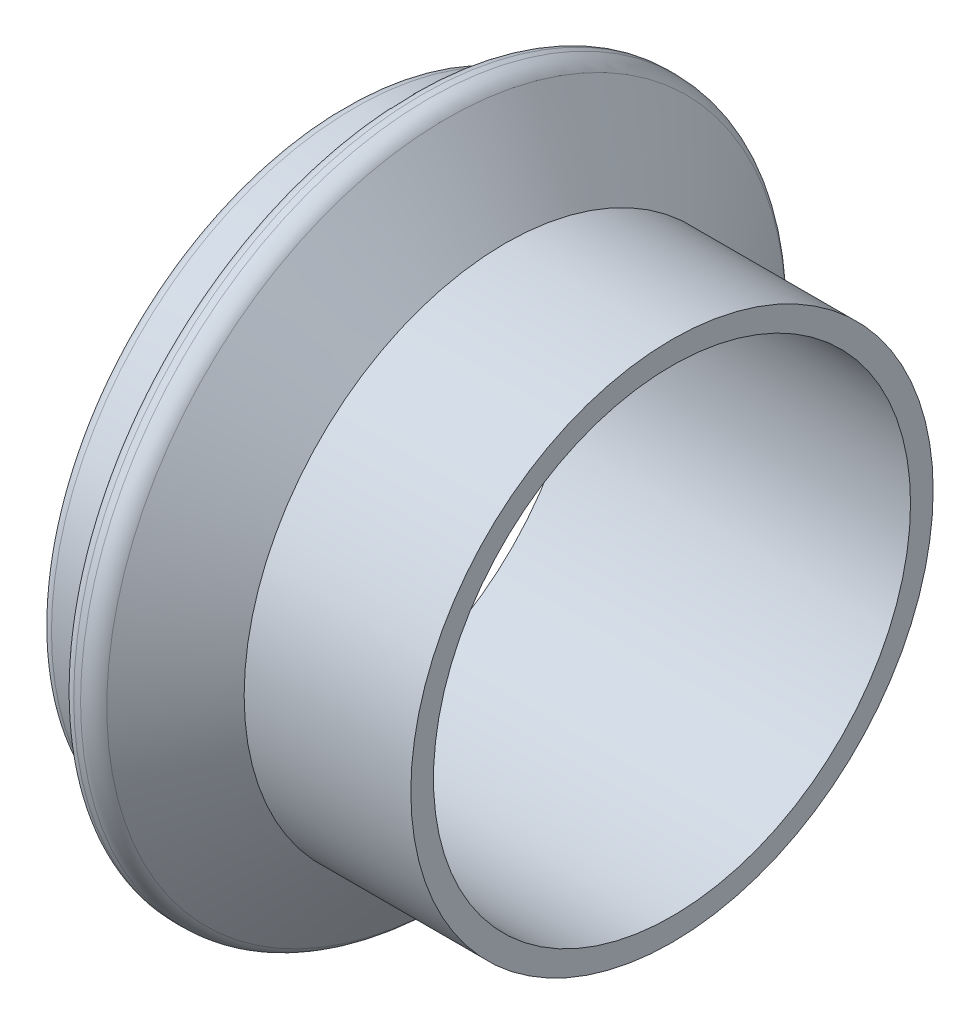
from build123d import *


with BuildPart() as part:
    # Sketch1 → Revolve1 (revolve)
    with BuildSketch(Plane.XY, mode=Mode.PRIVATE) as revolve1_sk:
        with BuildLine():
            Line((0.751416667, 17.399), (-23.251583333, 17.399))
            Line((-23.251583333, 17.399), (-23.251583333, 21.2598))
            ThreePointArc((-23.251583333, 21.2598), (-23.013519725, 21.834536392), (-22.438783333, 22.0726))
            Line((-22.438783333, 22.0726), (-19.111383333, 22.0726))
            ThreePointArc((-19.111383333, 22.0726), (-18.536646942, 22.310663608), (-18.298583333, 22.8854))
            Line((-18.298583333, 22.8854), (-18.298583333, 24.5872))
            ThreePointArc((-18.298583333, 24.5872), (-18.060519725, 25.161936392), (-17.485783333, 25.4))
            Line((-17.485783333, 25.4), (-16.988213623, 25.4))
            ThreePointArc((-16.988213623, 25.4), (-16.274207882, 25.231873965), (-15.710237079, 24.7628244))
            Line((-15.710237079, 24.7628244), (-11.405315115, 19.05))
            Line((-11.405315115, 19.05), (0.751416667, 19.05))
            Line((0.751416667, 19.05), (0.751416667, 17.399))
        make_face()
    revolve(revolve1_sk.sketch.rotate(Axis((0, 0, 0), (-1, 0, 0)), 90), axis=Axis((0, 0, 0), (-1, 0, 0)))


solid = part.part
